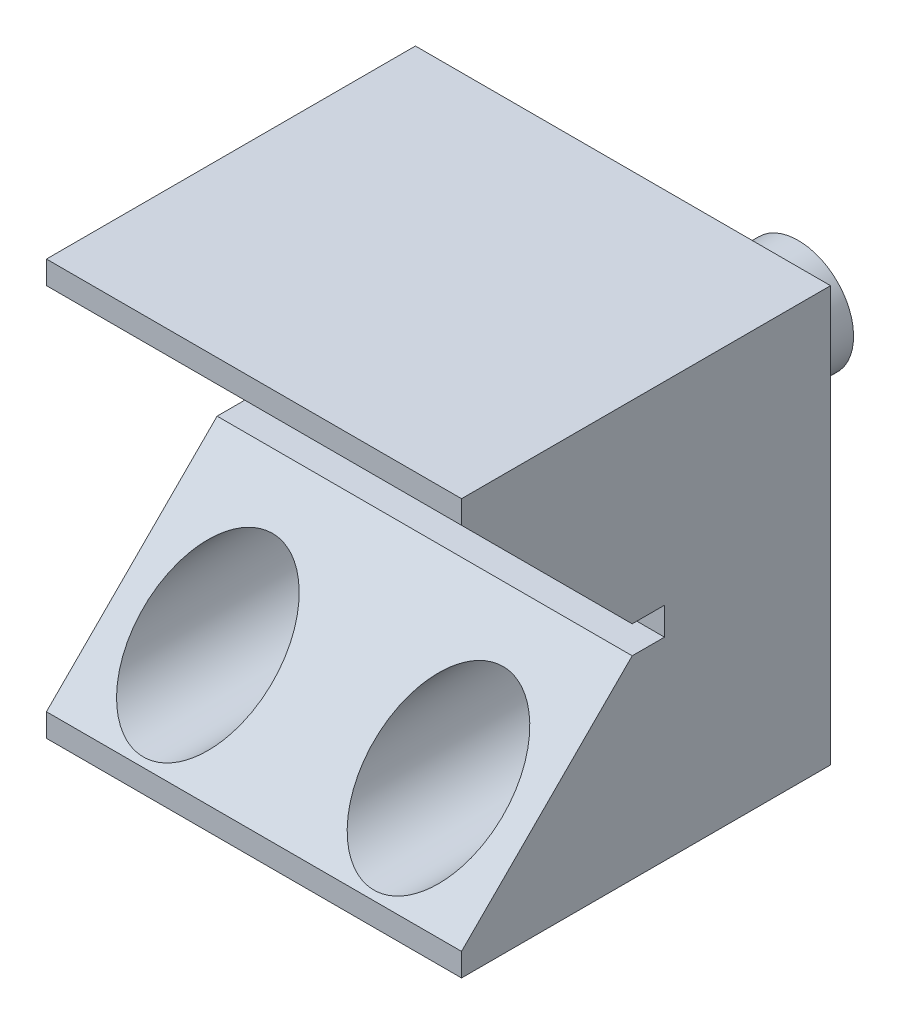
ISO-10303-21;
HEADER;
FILE_DESCRIPTION(('STEP AP214'),'2;1');
FILE_NAME('part.step','',(''),(''),'','','');
FILE_SCHEMA(('AUTOMOTIVE_DESIGN { 1 0 10303 214 1 1 1 1 }'));
ENDSEC;
DATA;
#1=APPLICATION_CONTEXT('core data for automotive mechanical design processes');
#2=APPLICATION_PROTOCOL_DEFINITION('international standard','automotive_design',2000,#1);
#3=PRODUCT_CONTEXT('',#1,'mechanical');
#4=PRODUCT('Part','Part','',(#3));
#5=PRODUCT_RELATED_PRODUCT_CATEGORY('part','',(#4));
#6=PRODUCT_DEFINITION_FORMATION('','',#4);
#7=PRODUCT_DEFINITION_CONTEXT('part definition',#1,'design');
#8=PRODUCT_DEFINITION('design','',#6,#7);
#9=PRODUCT_DEFINITION_SHAPE('','',#8);
#10=(LENGTH_UNIT() NAMED_UNIT(*) SI_UNIT(.MILLI.,.METRE.));
#11=(NAMED_UNIT(*) PLANE_ANGLE_UNIT() SI_UNIT($,.RADIAN.));
#12=(NAMED_UNIT(*) SI_UNIT($,.STERADIAN.) SOLID_ANGLE_UNIT());
#13=UNCERTAINTY_MEASURE_WITH_UNIT(LENGTH_MEASURE(1.E-05),#10,'distance_accuracy_value','');
#14=(GEOMETRIC_REPRESENTATION_CONTEXT(3) GLOBAL_UNCERTAINTY_ASSIGNED_CONTEXT((#13)) GLOBAL_UNIT_ASSIGNED_CONTEXT((#10,
#11,#12)) REPRESENTATION_CONTEXT('',''));
#15=CARTESIAN_POINT('',(0.,0.,0.));
#16=DIRECTION('',(0.,0.,1.));
#17=DIRECTION('',(1.,0.,0.));
#18=AXIS2_PLACEMENT_3D('',#15,#16,#17);
#19=CARTESIAN_POINT('',(35.,-10.,0.));
#20=DIRECTION('',(0.,0.,1.));
#21=DIRECTION('',(0.,-1.,0.));
#22=AXIS2_PLACEMENT_3D('',#19,#20,#21);
#23=PLANE('',#22);
#24=CARTESIAN_POINT('',(0.,0.,0.));
#25=DIRECTION('',(0.,0.,1.));
#26=DIRECTION('',(0.,-1.,0.));
#27=AXIS2_PLACEMENT_3D('',#24,#25,#26);
#28=CIRCLE('',#27,6.);
#29=CARTESIAN_POINT('',(0.,-6.,0.));
#30=VERTEX_POINT('',#29);
#31=EDGE_CURVE('E358',#30,#30,#28,.T.);
#32=ORIENTED_EDGE('',*,*,#31,.T.);
#33=EDGE_LOOP('',(#32));
#34=FACE_BOUND('',#33,.T.);
#35=CARTESIAN_POINT('',(25.,25.,0.));
#36=DIRECTION('',(0.,0.,1.));
#37=DIRECTION('',(0.,-1.,0.));
#38=AXIS2_PLACEMENT_3D('',#35,#36,#37);
#39=CIRCLE('',#38,6.);
#40=CARTESIAN_POINT('',(25.,19.,0.));
#41=VERTEX_POINT('',#40);
#42=EDGE_CURVE('E374',#41,#41,#39,.T.);
#43=ORIENTED_EDGE('',*,*,#42,.T.);
#44=EDGE_LOOP('',(#43));
#45=FACE_BOUND('',#44,.T.);
#46=CARTESIAN_POINT('',(0.,25.,0.));
#47=DIRECTION('',(0.,0.,-1.));
#48=DIRECTION('',(0.,1.,0.));
#49=AXIS2_PLACEMENT_3D('',#46,#47,#48);
#50=CIRCLE('',#49,4.5);
#51=CARTESIAN_POINT('',(0.,29.5,0.));
#52=VERTEX_POINT('',#51);
#53=EDGE_CURVE('E182',#52,#52,#50,.T.);
#54=ORIENTED_EDGE('',*,*,#53,.F.);
#55=EDGE_LOOP('',(#54));
#56=FACE_BOUND('',#55,.T.);
#57=DIRECTION('',(-1.,0.,0.));
#58=VECTOR('',#57,1.);
#59=CARTESIAN_POINT('',(35.,35.,0.));
#60=LINE('',#59,#58);
#61=CARTESIAN_POINT('',(35.,35.,0.));
#62=VERTEX_POINT('',#61);
#63=CARTESIAN_POINT('',(-10.,35.,0.));
#64=VERTEX_POINT('',#63);
#65=EDGE_CURVE('E157',#62,#64,#60,.T.);
#66=ORIENTED_EDGE('',*,*,#65,.F.);
#67=DIRECTION('',(0.,1.,0.));
#68=VECTOR('',#67,1.);
#69=CARTESIAN_POINT('',(35.,-10.,0.));
#70=LINE('',#69,#68);
#71=CARTESIAN_POINT('',(35.,-10.,0.));
#72=VERTEX_POINT('',#71);
#73=EDGE_CURVE('E122',#72,#62,#70,.T.);
#74=ORIENTED_EDGE('',*,*,#73,.F.);
#75=DIRECTION('',(-1.,0.,0.));
#76=VECTOR('',#75,1.);
#77=CARTESIAN_POINT('',(35.,-10.,0.));
#78=LINE('',#77,#76);
#79=CARTESIAN_POINT('',(-10.,-10.,0.));
#80=VERTEX_POINT('',#79);
#81=EDGE_CURVE('E23',#72,#80,#78,.T.);
#82=ORIENTED_EDGE('',*,*,#81,.T.);
#83=DIRECTION('',(0.,1.,0.));
#84=VECTOR('',#83,1.);
#85=CARTESIAN_POINT('',(-10.,-10.,0.));
#86=LINE('',#85,#84);
#87=EDGE_CURVE('E195',#80,#64,#86,.T.);
#88=ORIENTED_EDGE('',*,*,#87,.T.);
#89=EDGE_LOOP('',(#66,#74,#82,#88));
#90=FACE_BOUND('',#89,.T.);
#91=CARTESIAN_POINT('',(25.,0.,0.));
#92=DIRECTION('',(0.,0.,-1.));
#93=DIRECTION('',(0.,1.,0.));
#94=AXIS2_PLACEMENT_3D('',#91,#92,#93);
#95=CIRCLE('',#94,4.5);
#96=CARTESIAN_POINT('',(25.,4.5,0.));
#97=VERTEX_POINT('',#96);
#98=EDGE_CURVE('E169',#97,#97,#95,.T.);
#99=ORIENTED_EDGE('',*,*,#98,.F.);
#100=EDGE_LOOP('',(#99));
#101=FACE_BOUND('',#100,.T.);
#102=ADVANCED_FACE('F14',(#34,#45,#56,#90,#101),#23,.F.);
#103=CARTESIAN_POINT('',(35.,-7.5,40.));
#104=DIRECTION('',(0.,0.707106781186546,0.707106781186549));
#105=DIRECTION('',(0.,-0.707106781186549,0.707106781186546));
#106=AXIS2_PLACEMENT_3D('',#103,#104,#105);
#107=PLANE('',#106);
#108=CARTESIAN_POINT('',(25.,0.,32.5));
#109=DIRECTION('',(0.,0.707106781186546,0.707106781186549));
#110=DIRECTION('',(0.,0.707106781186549,-0.707106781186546));
#111=AXIS2_PLACEMENT_3D('',#108,#109,#110);
#112=ELLIPSE('',#111,9.89949493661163,7.);
#113=CARTESIAN_POINT('',(25.,6.99999999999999,25.5));
#114=VERTEX_POINT('',#113);
#115=EDGE_CURVE('E163',#114,#114,#112,.F.);
#116=ORIENTED_EDGE('',*,*,#115,.T.);
#117=EDGE_LOOP('',(#116));
#118=FACE_BOUND('',#117,.T.);
#119=DIRECTION('',(0.,0.707106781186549,-0.707106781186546));
#120=VECTOR('',#119,1.);
#121=CARTESIAN_POINT('',(35.,-7.5,40.));
#122=LINE('',#121,#120);
#123=CARTESIAN_POINT('',(35.,-7.5,40.));
#124=VERTEX_POINT('',#123);
#125=CARTESIAN_POINT('',(35.,11.,21.5));
#126=VERTEX_POINT('',#125);
#127=EDGE_CURVE('E143',#124,#126,#122,.T.);
#128=ORIENTED_EDGE('',*,*,#127,.T.);
#129=DIRECTION('',(-1.,0.,0.));
#130=VECTOR('',#129,1.);
#131=CARTESIAN_POINT('',(35.,11.,21.5));
#132=LINE('',#131,#130);
#133=CARTESIAN_POINT('',(-10.,11.,21.5));
#134=VERTEX_POINT('',#133);
#135=EDGE_CURVE('E99',#126,#134,#132,.T.);
#136=ORIENTED_EDGE('',*,*,#135,.T.);
#137=DIRECTION('',(0.,0.707106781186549,-0.707106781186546));
#138=VECTOR('',#137,1.);
#139=CARTESIAN_POINT('',(-10.,-7.5,40.));
#140=LINE('',#139,#138);
#141=CARTESIAN_POINT('',(-10.,-7.5,40.));
#142=VERTEX_POINT('',#141);
#143=EDGE_CURVE('E106',#142,#134,#140,.T.);
#144=ORIENTED_EDGE('',*,*,#143,.F.);
#145=DIRECTION('',(-1.,0.,0.));
#146=VECTOR('',#145,1.);
#147=CARTESIAN_POINT('',(35.,-7.5,40.));
#148=LINE('',#147,#146);
#149=EDGE_CURVE('E89',#124,#142,#148,.T.);
#150=ORIENTED_EDGE('',*,*,#149,.F.);
#151=EDGE_LOOP('',(#128,#136,#144,#150));
#152=FACE_BOUND('',#151,.T.);
#153=CARTESIAN_POINT('',(0.,0.,32.5));
#154=DIRECTION('',(0.,0.707106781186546,0.707106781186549));
#155=DIRECTION('',(0.,0.707106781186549,-0.707106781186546));
#156=AXIS2_PLACEMENT_3D('',#153,#154,#155);
#157=ELLIPSE('',#156,9.89949493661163,7.);
#158=CARTESIAN_POINT('',(0.,6.99999999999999,25.5));
#159=VERTEX_POINT('',#158);
#160=EDGE_CURVE('E18',#159,#159,#157,.F.);
#161=ORIENTED_EDGE('',*,*,#160,.T.);
#162=EDGE_LOOP('',(#161));
#163=FACE_BOUND('',#162,.T.);
#164=ADVANCED_FACE('F112',(#118,#152,#163),#107,.T.);
#165=CARTESIAN_POINT('',(35.,32.5,40.));
#166=DIRECTION('',(0.,0.707106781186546,-0.707106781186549));
#167=DIRECTION('',(0.,0.707106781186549,0.707106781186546));
#168=AXIS2_PLACEMENT_3D('',#165,#166,#167);
#169=PLANE('',#168);
#170=CARTESIAN_POINT('',(25.,25.,32.5));
#171=DIRECTION('',(0.,0.707106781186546,-0.707106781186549));
#172=DIRECTION('',(0.,-0.707106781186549,-0.707106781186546));
#173=AXIS2_PLACEMENT_3D('',#170,#171,#172);
#174=ELLIPSE('',#173,9.89949493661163,7.);
#175=CARTESIAN_POINT('',(25.,18.,25.5));
#176=VERTEX_POINT('',#175);
#177=EDGE_CURVE('E110',#176,#176,#174,.F.);
#178=ORIENTED_EDGE('',*,*,#177,.F.);
#179=EDGE_LOOP('',(#178));
#180=FACE_BOUND('',#179,.T.);
#181=DIRECTION('',(-1.,0.,0.));
#182=VECTOR('',#181,1.);
#183=CARTESIAN_POINT('',(35.,14.,21.5));
#184=LINE('',#183,#182);
#185=CARTESIAN_POINT('',(35.,14.,21.5));
#186=VERTEX_POINT('',#185);
#187=CARTESIAN_POINT('',(-10.,14.,21.5));
#188=VERTEX_POINT('',#187);
#189=EDGE_CURVE('E151',#186,#188,#184,.T.);
#190=ORIENTED_EDGE('',*,*,#189,.F.);
#191=DIRECTION('',(0.,-0.707106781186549,-0.707106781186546));
#192=VECTOR('',#191,1.);
#193=CARTESIAN_POINT('',(35.,32.5,40.));
#194=LINE('',#193,#192);
#195=CARTESIAN_POINT('',(35.,32.5,40.));
#196=VERTEX_POINT('',#195);
#197=EDGE_CURVE('E131',#196,#186,#194,.T.);
#198=ORIENTED_EDGE('',*,*,#197,.F.);
#199=DIRECTION('',(-1.,0.,0.));
#200=VECTOR('',#199,1.);
#201=CARTESIAN_POINT('',(35.,32.5,40.));
#202=LINE('',#201,#200);
#203=CARTESIAN_POINT('',(-10.,32.5,40.));
#204=VERTEX_POINT('',#203);
#205=EDGE_CURVE('E153',#196,#204,#202,.T.);
#206=ORIENTED_EDGE('',*,*,#205,.T.);
#207=DIRECTION('',(0.,-0.707106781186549,-0.707106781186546));
#208=VECTOR('',#207,1.);
#209=CARTESIAN_POINT('',(-10.,32.5,40.));
#210=LINE('',#209,#208);
#211=EDGE_CURVE('E204',#204,#188,#210,.T.);
#212=ORIENTED_EDGE('',*,*,#211,.T.);
#213=EDGE_LOOP('',(#190,#198,#206,#212));
#214=FACE_BOUND('',#213,.T.);
#215=CARTESIAN_POINT('',(0.,25.,32.5));
#216=DIRECTION('',(0.,0.707106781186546,-0.707106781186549));
#217=DIRECTION('',(0.,-0.707106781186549,-0.707106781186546));
#218=AXIS2_PLACEMENT_3D('',#215,#216,#217);
#219=ELLIPSE('',#218,9.89949493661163,7.);
#220=CARTESIAN_POINT('',(0.,18.,25.5));
#221=VERTEX_POINT('',#220);
#222=EDGE_CURVE('E167',#221,#221,#219,.F.);
#223=ORIENTED_EDGE('',*,*,#222,.F.);
#224=EDGE_LOOP('',(#223));
#225=FACE_BOUND('',#224,.T.);
#226=ADVANCED_FACE('F219',(#180,#214,#225),#169,.F.);
#227=CARTESIAN_POINT('',(35.,-10.,40.));
#228=DIRECTION('',(0.,0.,1.));
#229=DIRECTION('',(0.,-1.,0.));
#230=AXIS2_PLACEMENT_3D('',#227,#228,#229);
#231=PLANE('',#230);
#232=DIRECTION('',(-1.,0.,0.));
#233=VECTOR('',#232,1.);
#234=CARTESIAN_POINT('',(35.,-10.,40.));
#235=LINE('',#234,#233);
#236=CARTESIAN_POINT('',(35.,-10.,40.));
#237=VERTEX_POINT('',#236);
#238=CARTESIAN_POINT('',(-10.,-10.,40.));
#239=VERTEX_POINT('',#238);
#240=EDGE_CURVE('E9',#237,#239,#235,.T.);
#241=ORIENTED_EDGE('',*,*,#240,.F.);
#242=DIRECTION('',(0.,1.,0.));
#243=VECTOR('',#242,1.);
#244=CARTESIAN_POINT('',(35.,-10.,40.));
#245=LINE('',#244,#243);
#246=EDGE_CURVE('E94',#237,#124,#245,.T.);
#247=ORIENTED_EDGE('',*,*,#246,.T.);
#248=ORIENTED_EDGE('',*,*,#149,.T.);
#249=DIRECTION('',(0.,1.,0.));
#250=VECTOR('',#249,1.);
#251=CARTESIAN_POINT('',(-10.,-10.,40.));
#252=LINE('',#251,#250);
#253=EDGE_CURVE('E92',#239,#142,#252,.T.);
#254=ORIENTED_EDGE('',*,*,#253,.F.);
#255=EDGE_LOOP('',(#241,#247,#248,#254));
#256=FACE_BOUND('',#255,.T.);
#257=ADVANCED_FACE('F91',(#256),#231,.T.);
#258=CARTESIAN_POINT('',(35.,-10.,40.));
#259=DIRECTION('',(0.,1.,0.));
#260=DIRECTION('',(0.,0.,1.));
#261=AXIS2_PLACEMENT_3D('',#258,#259,#260);
#262=PLANE('',#261);
#263=ORIENTED_EDGE('',*,*,#81,.F.);
#264=DIRECTION('',(0.,0.,-1.));
#265=VECTOR('',#264,1.);
#266=CARTESIAN_POINT('',(35.,-10.,40.));
#267=LINE('',#266,#265);
#268=EDGE_CURVE('E100',#237,#72,#267,.T.);
#269=ORIENTED_EDGE('',*,*,#268,.F.);
#270=ORIENTED_EDGE('',*,*,#240,.T.);
#271=DIRECTION('',(0.,0.,-1.));
#272=VECTOR('',#271,1.);
#273=CARTESIAN_POINT('',(-10.,-10.,40.));
#274=LINE('',#273,#272);
#275=EDGE_CURVE('E109',#239,#80,#274,.T.);
#276=ORIENTED_EDGE('',*,*,#275,.T.);
#277=EDGE_LOOP('',(#263,#269,#270,#276));
#278=FACE_BOUND('',#277,.T.);
#279=ADVANCED_FACE('F16',(#278),#262,.F.);
#280=CARTESIAN_POINT('',(35.,35.,0.));
#281=DIRECTION('',(0.,-1.,0.));
#282=DIRECTION('',(0.,0.,-1.));
#283=AXIS2_PLACEMENT_3D('',#280,#281,#282);
#284=PLANE('',#283);
#285=DIRECTION('',(-1.,0.,0.));
#286=VECTOR('',#285,1.);
#287=CARTESIAN_POINT('',(35.,35.,40.));
#288=LINE('',#287,#286);
#289=CARTESIAN_POINT('',(35.,35.,40.));
#290=VERTEX_POINT('',#289);
#291=CARTESIAN_POINT('',(-10.,35.,40.));
#292=VERTEX_POINT('',#291);
#293=EDGE_CURVE('E155',#290,#292,#288,.T.);
#294=ORIENTED_EDGE('',*,*,#293,.F.);
#295=DIRECTION('',(0.,0.,1.));
#296=VECTOR('',#295,1.);
#297=CARTESIAN_POINT('',(35.,35.,0.));
#298=LINE('',#297,#296);
#299=EDGE_CURVE('E125',#62,#290,#298,.T.);
#300=ORIENTED_EDGE('',*,*,#299,.F.);
#301=ORIENTED_EDGE('',*,*,#65,.T.);
#302=DIRECTION('',(0.,0.,1.));
#303=VECTOR('',#302,1.);
#304=CARTESIAN_POINT('',(-10.,35.,0.));
#305=LINE('',#304,#303);
#306=EDGE_CURVE('E198',#64,#292,#305,.T.);
#307=ORIENTED_EDGE('',*,*,#306,.T.);
#308=EDGE_LOOP('',(#294,#300,#301,#307));
#309=FACE_BOUND('',#308,.T.);
#310=ADVANCED_FACE('F228',(#309),#284,.F.);
#311=CARTESIAN_POINT('',(35.,35.,40.));
#312=DIRECTION('',(0.,0.,-1.));
#313=DIRECTION('',(0.,1.,0.));
#314=AXIS2_PLACEMENT_3D('',#311,#312,#313);
#315=PLANE('',#314);
#316=ORIENTED_EDGE('',*,*,#205,.F.);
#317=DIRECTION('',(0.,-1.,0.));
#318=VECTOR('',#317,1.);
#319=CARTESIAN_POINT('',(35.,35.,40.));
#320=LINE('',#319,#318);
#321=EDGE_CURVE('E128',#290,#196,#320,.T.);
#322=ORIENTED_EDGE('',*,*,#321,.F.);
#323=ORIENTED_EDGE('',*,*,#293,.T.);
#324=DIRECTION('',(0.,-1.,0.));
#325=VECTOR('',#324,1.);
#326=CARTESIAN_POINT('',(-10.,35.,40.));
#327=LINE('',#326,#325);
#328=EDGE_CURVE('E201',#292,#204,#327,.T.);
#329=ORIENTED_EDGE('',*,*,#328,.T.);
#330=EDGE_LOOP('',(#316,#322,#323,#329));
#331=FACE_BOUND('',#330,.T.);
#332=ADVANCED_FACE('F224',(#331),#315,.F.);
#333=CARTESIAN_POINT('',(35.,14.,18.));
#334=DIRECTION('',(0.,-1.,0.));
#335=DIRECTION('',(0.,0.,-1.));
#336=AXIS2_PLACEMENT_3D('',#333,#334,#335);
#337=PLANE('',#336);
#338=DIRECTION('',(-1.,0.,0.));
#339=VECTOR('',#338,1.);
#340=CARTESIAN_POINT('',(35.,14.,18.));
#341=LINE('',#340,#339);
#342=CARTESIAN_POINT('',(35.,14.,18.));
#343=VERTEX_POINT('',#342);
#344=CARTESIAN_POINT('',(-10.,14.,18.));
#345=VERTEX_POINT('',#344);
#346=EDGE_CURVE('E149',#343,#345,#341,.T.);
#347=ORIENTED_EDGE('',*,*,#346,.F.);
#348=DIRECTION('',(0.,0.,1.));
#349=VECTOR('',#348,1.);
#350=CARTESIAN_POINT('',(35.,14.,18.));
#351=LINE('',#350,#349);
#352=EDGE_CURVE('E134',#343,#186,#351,.T.);
#353=ORIENTED_EDGE('',*,*,#352,.T.);
#354=ORIENTED_EDGE('',*,*,#189,.T.);
#355=DIRECTION('',(0.,0.,1.));
#356=VECTOR('',#355,1.);
#357=CARTESIAN_POINT('',(-10.,14.,18.));
#358=LINE('',#357,#356);
#359=EDGE_CURVE('E207',#345,#188,#358,.T.);
#360=ORIENTED_EDGE('',*,*,#359,.F.);
#361=EDGE_LOOP('',(#347,#353,#354,#360));
#362=FACE_BOUND('',#361,.T.);
#363=ADVANCED_FACE('F215',(#362),#337,.T.);
#364=CARTESIAN_POINT('',(35.,11.,18.));
#365=DIRECTION('',(0.,0.,1.));
#366=DIRECTION('',(0.,-1.,0.));
#367=AXIS2_PLACEMENT_3D('',#364,#365,#366);
#368=PLANE('',#367);
#369=DIRECTION('',(-1.,0.,0.));
#370=VECTOR('',#369,1.);
#371=CARTESIAN_POINT('',(35.,11.,18.));
#372=LINE('',#371,#370);
#373=CARTESIAN_POINT('',(35.,11.,18.));
#374=VERTEX_POINT('',#373);
#375=CARTESIAN_POINT('',(-10.,11.,18.));
#376=VERTEX_POINT('',#375);
#377=EDGE_CURVE('E147',#374,#376,#372,.T.);
#378=ORIENTED_EDGE('',*,*,#377,.F.);
#379=DIRECTION('',(0.,1.,0.));
#380=VECTOR('',#379,1.);
#381=CARTESIAN_POINT('',(35.,11.,18.));
#382=LINE('',#381,#380);
#383=EDGE_CURVE('E137',#374,#343,#382,.T.);
#384=ORIENTED_EDGE('',*,*,#383,.T.);
#385=ORIENTED_EDGE('',*,*,#346,.T.);
#386=DIRECTION('',(0.,1.,0.));
#387=VECTOR('',#386,1.);
#388=CARTESIAN_POINT('',(-10.,11.,18.));
#389=LINE('',#388,#387);
#390=EDGE_CURVE('E116',#376,#345,#389,.T.);
#391=ORIENTED_EDGE('',*,*,#390,.F.);
#392=EDGE_LOOP('',(#378,#384,#385,#391));
#393=FACE_BOUND('',#392,.T.);
#394=ADVANCED_FACE('F258',(#393),#368,.T.);
#395=CARTESIAN_POINT('',(35.,11.,18.));
#396=DIRECTION('',(0.,-1.,0.));
#397=DIRECTION('',(0.,0.,-1.));
#398=AXIS2_PLACEMENT_3D('',#395,#396,#397);
#399=PLANE('',#398);
#400=ORIENTED_EDGE('',*,*,#135,.F.);
#401=DIRECTION('',(0.,0.,1.));
#402=VECTOR('',#401,1.);
#403=CARTESIAN_POINT('',(35.,11.,18.));
#404=LINE('',#403,#402);
#405=EDGE_CURVE('E140',#374,#126,#404,.T.);
#406=ORIENTED_EDGE('',*,*,#405,.F.);
#407=ORIENTED_EDGE('',*,*,#377,.T.);
#408=DIRECTION('',(0.,0.,1.));
#409=VECTOR('',#408,1.);
#410=CARTESIAN_POINT('',(-10.,11.,18.));
#411=LINE('',#410,#409);
#412=EDGE_CURVE('E114',#376,#134,#411,.T.);
#413=ORIENTED_EDGE('',*,*,#412,.T.);
#414=EDGE_LOOP('',(#400,#406,#407,#413));
#415=FACE_BOUND('',#414,.T.);
#416=ADVANCED_FACE('F261',(#415),#399,.F.);
#417=CARTESIAN_POINT('',(35.,35.,40.));
#418=DIRECTION('',(1.,0.,0.));
#419=DIRECTION('',(0.,0.,1.));
#420=AXIS2_PLACEMENT_3D('',#417,#418,#419);
#421=PLANE('',#420);
#422=ORIENTED_EDGE('',*,*,#246,.F.);
#423=ORIENTED_EDGE('',*,*,#268,.T.);
#424=ORIENTED_EDGE('',*,*,#73,.T.);
#425=ORIENTED_EDGE('',*,*,#299,.T.);
#426=ORIENTED_EDGE('',*,*,#321,.T.);
#427=ORIENTED_EDGE('',*,*,#197,.T.);
#428=ORIENTED_EDGE('',*,*,#352,.F.);
#429=ORIENTED_EDGE('',*,*,#383,.F.);
#430=ORIENTED_EDGE('',*,*,#405,.T.);
#431=ORIENTED_EDGE('',*,*,#127,.F.);
#432=EDGE_LOOP('',(#422,#423,#424,#425,#426,#427,#428,#429,#430,#431));
#433=FACE_BOUND('',#432,.T.);
#434=ADVANCED_FACE('F232',(#433),#421,.T.);
#435=CARTESIAN_POINT('',(-10.,35.,40.));
#436=DIRECTION('',(1.,0.,0.));
#437=DIRECTION('',(0.,0.,1.));
#438=AXIS2_PLACEMENT_3D('',#435,#436,#437);
#439=PLANE('',#438);
#440=ORIENTED_EDGE('',*,*,#253,.T.);
#441=ORIENTED_EDGE('',*,*,#143,.T.);
#442=ORIENTED_EDGE('',*,*,#412,.F.);
#443=ORIENTED_EDGE('',*,*,#390,.T.);
#444=ORIENTED_EDGE('',*,*,#359,.T.);
#445=ORIENTED_EDGE('',*,*,#211,.F.);
#446=ORIENTED_EDGE('',*,*,#328,.F.);
#447=ORIENTED_EDGE('',*,*,#306,.F.);
#448=ORIENTED_EDGE('',*,*,#87,.F.);
#449=ORIENTED_EDGE('',*,*,#275,.F.);
#450=EDGE_LOOP('',(#440,#441,#442,#443,#444,#445,#446,#447,#448,#449));
#451=FACE_BOUND('',#450,.T.);
#452=ADVANCED_FACE('F104',(#451),#439,.F.);
#453=CARTESIAN_POINT('',(25.,25.,0.));
#454=DIRECTION('',(0.,0.,-1.));
#455=DIRECTION('',(0.,1.,0.));
#456=AXIS2_PLACEMENT_3D('',#453,#454,#455);
#457=CYLINDRICAL_SURFACE('',#456,7.);
#458=CARTESIAN_POINT('',(25.,25.,15.));
#459=DIRECTION('',(0.,0.,-1.));
#460=DIRECTION('',(0.,1.,0.));
#461=AXIS2_PLACEMENT_3D('',#458,#459,#460);
#462=CIRCLE('',#461,7.);
#463=CARTESIAN_POINT('',(25.,32.,15.));
#464=VERTEX_POINT('',#463);
#465=EDGE_CURVE('E162',#464,#464,#462,.T.);
#466=ORIENTED_EDGE('',*,*,#465,.T.);
#467=EDGE_LOOP('',(#466));
#468=FACE_BOUND('',#467,.T.);
#469=ORIENTED_EDGE('',*,*,#177,.T.);
#470=EDGE_LOOP('',(#469));
#471=FACE_BOUND('',#470,.T.);
#472=ADVANCED_FACE('F269',(#468,#471),#457,.F.);
#473=CARTESIAN_POINT('',(25.,18.,15.));
#474=DIRECTION('',(0.,0.,1.));
#475=DIRECTION('',(0.,-1.,0.));
#476=AXIS2_PLACEMENT_3D('',#473,#474,#475);
#477=PLANE('',#476);
#478=CARTESIAN_POINT('',(25.,25.,15.));
#479=DIRECTION('',(0.,0.,-1.));
#480=DIRECTION('',(0.,1.,0.));
#481=AXIS2_PLACEMENT_3D('',#478,#479,#480);
#482=CIRCLE('',#481,4.5);
#483=CARTESIAN_POINT('',(25.,29.5,15.));
#484=VERTEX_POINT('',#483);
#485=EDGE_CURVE('E165',#484,#484,#482,.T.);
#486=ORIENTED_EDGE('',*,*,#485,.T.);
#487=EDGE_LOOP('',(#486));
#488=FACE_BOUND('',#487,.T.);
#489=ORIENTED_EDGE('',*,*,#465,.F.);
#490=EDGE_LOOP('',(#489));
#491=FACE_BOUND('',#490,.T.);
#492=ADVANCED_FACE('F272',(#488,#491),#477,.T.);
#493=CARTESIAN_POINT('',(25.,25.,0.));
#494=DIRECTION('',(0.,0.,-1.));
#495=DIRECTION('',(0.,1.,0.));
#496=AXIS2_PLACEMENT_3D('',#493,#494,#495);
#497=CYLINDRICAL_SURFACE('',#496,4.5);
#498=CARTESIAN_POINT('',(25.,25.,0.));
#499=DIRECTION('',(0.,0.,1.));
#500=DIRECTION('',(0.,-1.,0.));
#501=AXIS2_PLACEMENT_3D('',#498,#499,#500);
#502=CIRCLE('',#501,4.5);
#503=CARTESIAN_POINT('',(25.,20.5,0.));
#504=VERTEX_POINT('',#503);
#505=EDGE_CURVE('E380',#504,#504,#502,.T.);
#506=ORIENTED_EDGE('',*,*,#505,.F.);
#507=EDGE_LOOP('',(#506));
#508=FACE_BOUND('',#507,.T.);
#509=ORIENTED_EDGE('',*,*,#485,.F.);
#510=EDGE_LOOP('',(#509));
#511=FACE_BOUND('',#510,.T.);
#512=ADVANCED_FACE('F276',(#508,#511),#497,.F.);
#513=CARTESIAN_POINT('',(25.,0.,0.));
#514=DIRECTION('',(0.,0.,-1.));
#515=DIRECTION('',(0.,1.,0.));
#516=AXIS2_PLACEMENT_3D('',#513,#514,#515);
#517=CYLINDRICAL_SURFACE('',#516,7.);
#518=ORIENTED_EDGE('',*,*,#115,.F.);
#519=EDGE_LOOP('',(#518));
#520=FACE_BOUND('',#519,.T.);
#521=CARTESIAN_POINT('',(25.,0.,15.));
#522=DIRECTION('',(0.,0.,-1.));
#523=DIRECTION('',(0.,1.,0.));
#524=AXIS2_PLACEMENT_3D('',#521,#522,#523);
#525=CIRCLE('',#524,7.);
#526=CARTESIAN_POINT('',(25.,7.,15.));
#527=VERTEX_POINT('',#526);
#528=EDGE_CURVE('E166',#527,#527,#525,.T.);
#529=ORIENTED_EDGE('',*,*,#528,.T.);
#530=EDGE_LOOP('',(#529));
#531=FACE_BOUND('',#530,.T.);
#532=ADVANCED_FACE('F280',(#520,#531),#517,.F.);
#533=CARTESIAN_POINT('',(25.,-7.,15.));
#534=DIRECTION('',(0.,0.,1.));
#535=DIRECTION('',(0.,-1.,0.));
#536=AXIS2_PLACEMENT_3D('',#533,#534,#535);
#537=PLANE('',#536);
#538=CARTESIAN_POINT('',(25.,0.,15.));
#539=DIRECTION('',(0.,0.,-1.));
#540=DIRECTION('',(0.,1.,0.));
#541=AXIS2_PLACEMENT_3D('',#538,#539,#540);
#542=CIRCLE('',#541,4.5);
#543=CARTESIAN_POINT('',(25.,4.5,15.));
#544=VERTEX_POINT('',#543);
#545=EDGE_CURVE('E174',#544,#544,#542,.T.);
#546=ORIENTED_EDGE('',*,*,#545,.T.);
#547=EDGE_LOOP('',(#546));
#548=FACE_BOUND('',#547,.T.);
#549=ORIENTED_EDGE('',*,*,#528,.F.);
#550=EDGE_LOOP('',(#549));
#551=FACE_BOUND('',#550,.T.);
#552=ADVANCED_FACE('F284',(#548,#551),#537,.T.);
#553=CARTESIAN_POINT('',(25.,0.,0.));
#554=DIRECTION('',(0.,0.,-1.));
#555=DIRECTION('',(0.,1.,0.));
#556=AXIS2_PLACEMENT_3D('',#553,#554,#555);
#557=CYLINDRICAL_SURFACE('',#556,4.5);
#558=ORIENTED_EDGE('',*,*,#98,.T.);
#559=EDGE_LOOP('',(#558));
#560=FACE_BOUND('',#559,.T.);
#561=ORIENTED_EDGE('',*,*,#545,.F.);
#562=EDGE_LOOP('',(#561));
#563=FACE_BOUND('',#562,.T.);
#564=ADVANCED_FACE('F288',(#560,#563),#557,.F.);
#565=CARTESIAN_POINT('',(0.,25.,0.));
#566=DIRECTION('',(0.,0.,-1.));
#567=DIRECTION('',(0.,1.,0.));
#568=AXIS2_PLACEMENT_3D('',#565,#566,#567);
#569=CYLINDRICAL_SURFACE('',#568,7.);
#570=CARTESIAN_POINT('',(0.,25.,15.));
#571=DIRECTION('',(0.,0.,-1.));
#572=DIRECTION('',(0.,1.,0.));
#573=AXIS2_PLACEMENT_3D('',#570,#571,#572);
#574=CIRCLE('',#573,7.);
#575=CARTESIAN_POINT('',(0.,32.,15.));
#576=VERTEX_POINT('',#575);
#577=EDGE_CURVE('E170',#576,#576,#574,.T.);
#578=ORIENTED_EDGE('',*,*,#577,.T.);
#579=EDGE_LOOP('',(#578));
#580=FACE_BOUND('',#579,.T.);
#581=ORIENTED_EDGE('',*,*,#222,.T.);
#582=EDGE_LOOP('',(#581));
#583=FACE_BOUND('',#582,.T.);
#584=ADVANCED_FACE('F292',(#580,#583),#569,.F.);
#585=CARTESIAN_POINT('',(0.,18.,15.));
#586=DIRECTION('',(0.,0.,1.));
#587=DIRECTION('',(0.,-1.,0.));
#588=AXIS2_PLACEMENT_3D('',#585,#586,#587);
#589=PLANE('',#588);
#590=CARTESIAN_POINT('',(0.,25.,15.));
#591=DIRECTION('',(0.,0.,-1.));
#592=DIRECTION('',(0.,1.,0.));
#593=AXIS2_PLACEMENT_3D('',#590,#591,#592);
#594=CIRCLE('',#593,4.5);
#595=CARTESIAN_POINT('',(0.,29.5,15.));
#596=VERTEX_POINT('',#595);
#597=EDGE_CURVE('E177',#596,#596,#594,.T.);
#598=ORIENTED_EDGE('',*,*,#597,.T.);
#599=EDGE_LOOP('',(#598));
#600=FACE_BOUND('',#599,.T.);
#601=ORIENTED_EDGE('',*,*,#577,.F.);
#602=EDGE_LOOP('',(#601));
#603=FACE_BOUND('',#602,.T.);
#604=ADVANCED_FACE('F296',(#600,#603),#589,.T.);
#605=CARTESIAN_POINT('',(0.,25.,0.));
#606=DIRECTION('',(0.,0.,-1.));
#607=DIRECTION('',(0.,1.,0.));
#608=AXIS2_PLACEMENT_3D('',#605,#606,#607);
#609=CYLINDRICAL_SURFACE('',#608,4.5);
#610=ORIENTED_EDGE('',*,*,#53,.T.);
#611=EDGE_LOOP('',(#610));
#612=FACE_BOUND('',#611,.T.);
#613=ORIENTED_EDGE('',*,*,#597,.F.);
#614=EDGE_LOOP('',(#613));
#615=FACE_BOUND('',#614,.T.);
#616=ADVANCED_FACE('F299',(#612,#615),#609,.F.);
#617=CARTESIAN_POINT('',(0.,0.,0.));
#618=DIRECTION('',(0.,0.,-1.));
#619=DIRECTION('',(0.,1.,0.));
#620=AXIS2_PLACEMENT_3D('',#617,#618,#619);
#621=CYLINDRICAL_SURFACE('',#620,7.);
#622=ORIENTED_EDGE('',*,*,#160,.F.);
#623=EDGE_LOOP('',(#622));
#624=FACE_BOUND('',#623,.T.);
#625=CARTESIAN_POINT('',(0.,0.,15.));
#626=DIRECTION('',(0.,0.,-1.));
#627=DIRECTION('',(0.,1.,0.));
#628=AXIS2_PLACEMENT_3D('',#625,#626,#627);
#629=CIRCLE('',#628,7.);
#630=CARTESIAN_POINT('',(0.,7.,15.));
#631=VERTEX_POINT('',#630);
#632=EDGE_CURVE('E386',#631,#631,#629,.T.);
#633=ORIENTED_EDGE('',*,*,#632,.T.);
#634=EDGE_LOOP('',(#633));
#635=FACE_BOUND('',#634,.T.);
#636=ADVANCED_FACE('F303',(#624,#635),#621,.F.);
#637=CARTESIAN_POINT('',(0.,-7.,15.));
#638=DIRECTION('',(0.,0.,1.));
#639=DIRECTION('',(0.,-1.,0.));
#640=AXIS2_PLACEMENT_3D('',#637,#638,#639);
#641=PLANE('',#640);
#642=CARTESIAN_POINT('',(0.,0.,15.));
#643=DIRECTION('',(0.,0.,-1.));
#644=DIRECTION('',(0.,1.,0.));
#645=AXIS2_PLACEMENT_3D('',#642,#643,#644);
#646=CIRCLE('',#645,4.5);
#647=CARTESIAN_POINT('',(0.,4.5,15.));
#648=VERTEX_POINT('',#647);
#649=EDGE_CURVE('E383',#648,#648,#646,.T.);
#650=ORIENTED_EDGE('',*,*,#649,.T.);
#651=EDGE_LOOP('',(#650));
#652=FACE_BOUND('',#651,.T.);
#653=ORIENTED_EDGE('',*,*,#632,.F.);
#654=EDGE_LOOP('',(#653));
#655=FACE_BOUND('',#654,.T.);
#656=ADVANCED_FACE('F307',(#652,#655),#641,.T.);
#657=CARTESIAN_POINT('',(0.,0.,0.));
#658=DIRECTION('',(0.,0.,-1.));
#659=DIRECTION('',(0.,1.,0.));
#660=AXIS2_PLACEMENT_3D('',#657,#658,#659);
#661=CYLINDRICAL_SURFACE('',#660,4.5);
#662=CARTESIAN_POINT('',(0.,0.,0.));
#663=DIRECTION('',(0.,0.,1.));
#664=DIRECTION('',(0.,-1.,0.));
#665=AXIS2_PLACEMENT_3D('',#662,#663,#664);
#666=CIRCLE('',#665,4.5);
#667=CARTESIAN_POINT('',(0.,-4.5,0.));
#668=VERTEX_POINT('',#667);
#669=EDGE_CURVE('E365',#668,#668,#666,.T.);
#670=ORIENTED_EDGE('',*,*,#669,.F.);
#671=EDGE_LOOP('',(#670));
#672=FACE_BOUND('',#671,.T.);
#673=ORIENTED_EDGE('',*,*,#649,.F.);
#674=EDGE_LOOP('',(#673));
#675=FACE_BOUND('',#674,.T.);
#676=ADVANCED_FACE('F311',(#672,#675),#661,.F.);
#677=CARTESIAN_POINT('',(25.,25.,-6.5));
#678=DIRECTION('',(0.,0.,1.));
#679=DIRECTION('',(0.,-1.,0.));
#680=AXIS2_PLACEMENT_3D('',#677,#678,#679);
#681=CYLINDRICAL_SURFACE('',#680,6.);
#682=CARTESIAN_POINT('',(25.,25.,-6.5));
#683=DIRECTION('',(0.,0.,1.));
#684=DIRECTION('',(0.,-1.,0.));
#685=AXIS2_PLACEMENT_3D('',#682,#683,#684);
#686=CIRCLE('',#685,6.);
#687=CARTESIAN_POINT('',(25.,19.,-6.5));
#688=VERTEX_POINT('',#687);
#689=EDGE_CURVE('E377',#688,#688,#686,.T.);
#690=ORIENTED_EDGE('',*,*,#689,.T.);
#691=EDGE_LOOP('',(#690));
#692=FACE_BOUND('',#691,.T.);
#693=ORIENTED_EDGE('',*,*,#42,.F.);
#694=EDGE_LOOP('',(#693));
#695=FACE_BOUND('',#694,.T.);
#696=ADVANCED_FACE('F315',(#692,#695),#681,.T.);
#697=CARTESIAN_POINT('',(25.,25.,-6.5));
#698=DIRECTION('',(0.,0.,1.));
#699=DIRECTION('',(0.,-1.,0.));
#700=AXIS2_PLACEMENT_3D('',#697,#698,#699);
#701=PLANE('',#700);
#702=CARTESIAN_POINT('',(25.,25.,-6.5));
#703=DIRECTION('',(0.,0.,1.));
#704=DIRECTION('',(0.,-1.,0.));
#705=AXIS2_PLACEMENT_3D('',#702,#703,#704);
#706=CIRCLE('',#705,4.25);
#707=CARTESIAN_POINT('',(25.,20.75,-6.5));
#708=VERTEX_POINT('',#707);
#709=EDGE_CURVE('E371',#708,#708,#706,.T.);
#710=ORIENTED_EDGE('',*,*,#709,.T.);
#711=EDGE_LOOP('',(#710));
#712=FACE_BOUND('',#711,.T.);
#713=ORIENTED_EDGE('',*,*,#689,.F.);
#714=EDGE_LOOP('',(#713));
#715=FACE_BOUND('',#714,.T.);
#716=ADVANCED_FACE('F317',(#712,#715),#701,.F.);
#717=CARTESIAN_POINT('',(25.,25.,0.));
#718=DIRECTION('',(0.,0.,1.));
#719=DIRECTION('',(0.,-1.,0.));
#720=AXIS2_PLACEMENT_3D('',#717,#718,#719);
#721=PLANE('',#720);
#722=ORIENTED_EDGE('',*,*,#505,.T.);
#723=EDGE_LOOP('',(#722));
#724=FACE_BOUND('',#723,.T.);
#725=CARTESIAN_POINT('',(25.,25.,0.));
#726=DIRECTION('',(0.,0.,1.));
#727=DIRECTION('',(0.,-1.,0.));
#728=AXIS2_PLACEMENT_3D('',#725,#726,#727);
#729=CIRCLE('',#728,4.25);
#730=CARTESIAN_POINT('',(25.,20.75,0.));
#731=VERTEX_POINT('',#730);
#732=EDGE_CURVE('E368',#731,#731,#729,.T.);
#733=ORIENTED_EDGE('',*,*,#732,.F.);
#734=EDGE_LOOP('',(#733));
#735=FACE_BOUND('',#734,.T.);
#736=ADVANCED_FACE('F321',(#724,#735),#721,.T.);
#737=CARTESIAN_POINT('',(25.,25.,-6.5));
#738=DIRECTION('',(0.,0.,1.));
#739=DIRECTION('',(0.,-1.,0.));
#740=AXIS2_PLACEMENT_3D('',#737,#738,#739);
#741=CYLINDRICAL_SURFACE('',#740,4.25);
#742=ORIENTED_EDGE('',*,*,#709,.F.);
#743=EDGE_LOOP('',(#742));
#744=FACE_BOUND('',#743,.T.);
#745=ORIENTED_EDGE('',*,*,#732,.T.);
#746=EDGE_LOOP('',(#745));
#747=FACE_BOUND('',#746,.T.);
#748=ADVANCED_FACE('F327',(#744,#747),#741,.F.);
#749=CARTESIAN_POINT('',(0.,0.,-6.5));
#750=DIRECTION('',(0.,0.,1.));
#751=DIRECTION('',(0.,-1.,0.));
#752=AXIS2_PLACEMENT_3D('',#749,#750,#751);
#753=CYLINDRICAL_SURFACE('',#752,6.);
#754=CARTESIAN_POINT('',(0.,0.,-6.5));
#755=DIRECTION('',(0.,0.,1.));
#756=DIRECTION('',(0.,-1.,0.));
#757=AXIS2_PLACEMENT_3D('',#754,#755,#756);
#758=CIRCLE('',#757,6.);
#759=CARTESIAN_POINT('',(0.,-6.,-6.5));
#760=VERTEX_POINT('',#759);
#761=EDGE_CURVE('E362',#760,#760,#758,.T.);
#762=ORIENTED_EDGE('',*,*,#761,.T.);
#763=EDGE_LOOP('',(#762));
#764=FACE_BOUND('',#763,.T.);
#765=ORIENTED_EDGE('',*,*,#31,.F.);
#766=EDGE_LOOP('',(#765));
#767=FACE_BOUND('',#766,.T.);
#768=ADVANCED_FACE('F331',(#764,#767),#753,.T.);
#769=CARTESIAN_POINT('',(0.,0.,-6.5));
#770=DIRECTION('',(0.,0.,1.));
#771=DIRECTION('',(0.,-1.,0.));
#772=AXIS2_PLACEMENT_3D('',#769,#770,#771);
#773=PLANE('',#772);
#774=CARTESIAN_POINT('',(0.,0.,-6.5));
#775=DIRECTION('',(0.,0.,1.));
#776=DIRECTION('',(0.,-1.,0.));
#777=AXIS2_PLACEMENT_3D('',#774,#775,#776);
#778=CIRCLE('',#777,4.25);
#779=CARTESIAN_POINT('',(0.,-4.25,-6.5));
#780=VERTEX_POINT('',#779);
#781=EDGE_CURVE('E352',#780,#780,#778,.T.);
#782=ORIENTED_EDGE('',*,*,#781,.T.);
#783=EDGE_LOOP('',(#782));
#784=FACE_BOUND('',#783,.T.);
#785=ORIENTED_EDGE('',*,*,#761,.F.);
#786=EDGE_LOOP('',(#785));
#787=FACE_BOUND('',#786,.T.);
#788=ADVANCED_FACE('F333',(#784,#787),#773,.F.);
#789=CARTESIAN_POINT('',(0.,0.,0.));
#790=DIRECTION('',(0.,0.,1.));
#791=DIRECTION('',(0.,-1.,0.));
#792=AXIS2_PLACEMENT_3D('',#789,#790,#791);
#793=PLANE('',#792);
#794=ORIENTED_EDGE('',*,*,#669,.T.);
#795=EDGE_LOOP('',(#794));
#796=FACE_BOUND('',#795,.T.);
#797=CARTESIAN_POINT('',(0.,0.,0.));
#798=DIRECTION('',(0.,0.,1.));
#799=DIRECTION('',(0.,-1.,0.));
#800=AXIS2_PLACEMENT_3D('',#797,#798,#799);
#801=CIRCLE('',#800,4.25);
#802=CARTESIAN_POINT('',(0.,-4.25,0.));
#803=VERTEX_POINT('',#802);
#804=EDGE_CURVE('E355',#803,#803,#801,.T.);
#805=ORIENTED_EDGE('',*,*,#804,.F.);
#806=EDGE_LOOP('',(#805));
#807=FACE_BOUND('',#806,.T.);
#808=ADVANCED_FACE('F337',(#796,#807),#793,.T.);
#809=CARTESIAN_POINT('',(0.,0.,-6.5));
#810=DIRECTION('',(0.,0.,1.));
#811=DIRECTION('',(0.,-1.,0.));
#812=AXIS2_PLACEMENT_3D('',#809,#810,#811);
#813=CYLINDRICAL_SURFACE('',#812,4.25);
#814=ORIENTED_EDGE('',*,*,#781,.F.);
#815=EDGE_LOOP('',(#814));
#816=FACE_BOUND('',#815,.T.);
#817=ORIENTED_EDGE('',*,*,#804,.T.);
#818=EDGE_LOOP('',(#817));
#819=FACE_BOUND('',#818,.T.);
#820=ADVANCED_FACE('F343',(#816,#819),#813,.F.);
#821=CLOSED_SHELL('',(#102,#164,#226,#257,#279,#310,#332,#363,#394,#416,#434,#452,#472,#492,
#512,#532,#552,#564,#584,#604,#616,#636,#656,#676,#696,#716,#736,#748,#768,#788,#808,#820));
#822=MANIFOLD_SOLID_BREP('B1',#821);
#823=ADVANCED_BREP_SHAPE_REPRESENTATION('',(#18,#822),#14);
#824=SHAPE_DEFINITION_REPRESENTATION(#9,#823);
ENDSEC;
END-ISO-10303-21;
